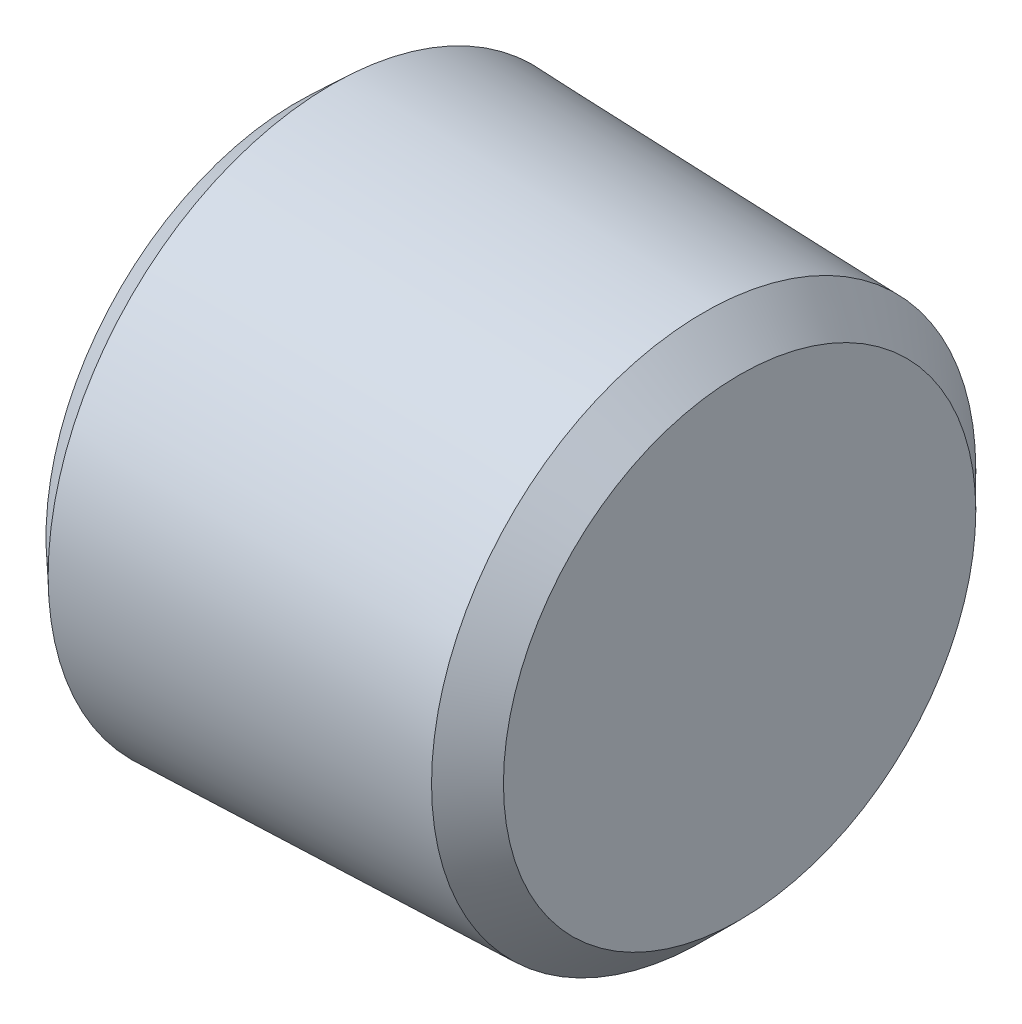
ISO-10303-21;
HEADER;
FILE_DESCRIPTION(('STEP AP214'),'2;1');
FILE_NAME('part.step','',(''),(''),'','','');
FILE_SCHEMA(('AUTOMOTIVE_DESIGN { 1 0 10303 214 1 1 1 1 }'));
ENDSEC;
DATA;
#1=APPLICATION_CONTEXT('core data for automotive mechanical design processes');
#2=APPLICATION_PROTOCOL_DEFINITION('international standard','automotive_design',2000,#1);
#3=PRODUCT_CONTEXT('',#1,'mechanical');
#4=PRODUCT('Part','Part','',(#3));
#5=PRODUCT_RELATED_PRODUCT_CATEGORY('part','',(#4));
#6=PRODUCT_DEFINITION_FORMATION('','',#4);
#7=PRODUCT_DEFINITION_CONTEXT('part definition',#1,'design');
#8=PRODUCT_DEFINITION('design','',#6,#7);
#9=PRODUCT_DEFINITION_SHAPE('','',#8);
#10=(LENGTH_UNIT() NAMED_UNIT(*) SI_UNIT(.MILLI.,.METRE.));
#11=(NAMED_UNIT(*) PLANE_ANGLE_UNIT() SI_UNIT($,.RADIAN.));
#12=(NAMED_UNIT(*) SI_UNIT($,.STERADIAN.) SOLID_ANGLE_UNIT());
#13=UNCERTAINTY_MEASURE_WITH_UNIT(LENGTH_MEASURE(1.E-05),#10,'distance_accuracy_value','');
#14=(GEOMETRIC_REPRESENTATION_CONTEXT(3) GLOBAL_UNCERTAINTY_ASSIGNED_CONTEXT((#13)) GLOBAL_UNIT_ASSIGNED_CONTEXT((#10,
#11,#12)) REPRESENTATION_CONTEXT('',''));
#15=CARTESIAN_POINT('',(0.,0.,0.));
#16=DIRECTION('',(0.,0.,1.));
#17=DIRECTION('',(1.,0.,0.));
#18=AXIS2_PLACEMENT_3D('',#15,#16,#17);
#19=CARTESIAN_POINT('',(10.8,6.61291308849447,0.));
#20=DIRECTION('',(-1.,0.,0.));
#21=DIRECTION('',(0.,0.,1.));
#22=AXIS2_PLACEMENT_3D('',#19,#20,#21);
#23=PLANE('',#22);
#24=CARTESIAN_POINT('',(10.8,0.,0.));
#25=DIRECTION('',(-1.,0.,0.));
#26=DIRECTION('',(0.,0.,1.));
#27=AXIS2_PLACEMENT_3D('',#24,#25,#26);
#28=CIRCLE('',#27,5.76291308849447);
#29=CARTESIAN_POINT('',(10.8,0.,5.76291308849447));
#30=VERTEX_POINT('',#29);
#31=EDGE_CURVE('E42',#30,#30,#28,.F.);
#32=ORIENTED_EDGE('',*,*,#31,.T.);
#33=EDGE_LOOP('',(#32));
#34=FACE_BOUND('',#33,.T.);
#35=ADVANCED_FACE('F34',(#34),#23,.F.);
#36=CARTESIAN_POINT('',(10.8,0.,0.));
#37=DIRECTION('',(-1.,0.,0.));
#38=DIRECTION('',(0.,0.,1.));
#39=AXIS2_PLACEMENT_3D('',#36,#37,#38);
#40=CONICAL_SURFACE('',#39,6.61291308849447,0.0311192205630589);
#41=CARTESIAN_POINT('',(9.92268997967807,0.,0.));
#42=DIRECTION('',(1.,0.,0.));
#43=DIRECTION('',(0.,0.,-1.));
#44=AXIS2_PLACEMENT_3D('',#41,#42,#43);
#45=CIRCLE('',#44,6.64022310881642);
#46=CARTESIAN_POINT('',(9.92268997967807,0.,-6.64022310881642));
#47=VERTEX_POINT('',#46);
#48=EDGE_CURVE('E144',#47,#47,#45,.F.);
#49=ORIENTED_EDGE('',*,*,#48,.T.);
#50=EDGE_LOOP('',(#49));
#51=FACE_BOUND('',#50,.T.);
#52=CARTESIAN_POINT('',(0.849588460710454,0.,0.));
#53=DIRECTION('',(1.,0.,0.));
#54=DIRECTION('',(0.,0.,-1.));
#55=AXIS2_PLACEMENT_3D('',#52,#53,#54);
#56=CIRCLE('',#55,6.92266213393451);
#57=CARTESIAN_POINT('',(0.849588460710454,0.,-6.92266213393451));
#58=VERTEX_POINT('',#57);
#59=EDGE_CURVE('E136',#58,#58,#56,.T.);
#60=ORIENTED_EDGE('',*,*,#59,.T.);
#61=EDGE_LOOP('',(#60));
#62=FACE_BOUND('',#61,.T.);
#63=ADVANCED_FACE('F159',(#51,#62),#40,.T.);
#64=CARTESIAN_POINT('',(0.,0.,0.));
#65=DIRECTION('',(1.,0.,0.));
#66=DIRECTION('',(0.,0.,-1.));
#67=AXIS2_PLACEMENT_3D('',#64,#65,#66);
#68=PLANE('',#67);
#69=DIRECTION('',(0.,0.866025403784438,-0.5));
#70=VECTOR('',#69,1.);
#71=CARTESIAN_POINT('',(0.,0.,3.66617420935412));
#72=LINE('',#71,#70);
#73=CARTESIAN_POINT('',(0.,0.,3.66617420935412));
#74=VERTEX_POINT('',#73);
#75=CARTESIAN_POINT('',(0.,3.175,1.83308710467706));
#76=VERTEX_POINT('',#75);
#77=EDGE_CURVE('E123',#74,#76,#72,.T.);
#78=ORIENTED_EDGE('',*,*,#77,.F.);
#79=DIRECTION('',(0.,0.866025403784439,0.5));
#80=VECTOR('',#79,1.);
#81=CARTESIAN_POINT('',(0.,-3.175,1.83308710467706));
#82=LINE('',#81,#80);
#83=CARTESIAN_POINT('',(0.,-3.175,1.83308710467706));
#84=VERTEX_POINT('',#83);
#85=EDGE_CURVE('E49',#84,#74,#82,.T.);
#86=ORIENTED_EDGE('',*,*,#85,.F.);
#87=DIRECTION('',(0.,0.,1.));
#88=VECTOR('',#87,1.);
#89=CARTESIAN_POINT('',(0.,-3.175,-1.83308710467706));
#90=LINE('',#89,#88);
#91=CARTESIAN_POINT('',(0.,-3.175,-1.83308710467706));
#92=VERTEX_POINT('',#91);
#93=EDGE_CURVE('E132',#92,#84,#90,.T.);
#94=ORIENTED_EDGE('',*,*,#93,.F.);
#95=DIRECTION('',(0.,-0.866025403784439,0.5));
#96=VECTOR('',#95,1.);
#97=CARTESIAN_POINT('',(0.,0.,-3.66617420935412));
#98=LINE('',#97,#96);
#99=CARTESIAN_POINT('',(0.,0.,-3.66617420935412));
#100=VERTEX_POINT('',#99);
#101=EDGE_CURVE('E130',#100,#92,#98,.T.);
#102=ORIENTED_EDGE('',*,*,#101,.F.);
#103=DIRECTION('',(0.,-0.866025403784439,-0.5));
#104=VECTOR('',#103,1.);
#105=CARTESIAN_POINT('',(0.,3.175,-1.83308710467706));
#106=LINE('',#105,#104);
#107=CARTESIAN_POINT('',(0.,3.175,-1.83308710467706));
#108=VERTEX_POINT('',#107);
#109=EDGE_CURVE('E97',#108,#100,#106,.T.);
#110=ORIENTED_EDGE('',*,*,#109,.F.);
#111=DIRECTION('',(0.,0.,-1.));
#112=VECTOR('',#111,1.);
#113=CARTESIAN_POINT('',(0.,3.175,1.83308710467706));
#114=LINE('',#113,#112);
#115=EDGE_CURVE('E126',#76,#108,#114,.T.);
#116=ORIENTED_EDGE('',*,*,#115,.F.);
#117=EDGE_LOOP('',(#78,#86,#94,#102,#110,#116));
#118=FACE_BOUND('',#117,.T.);
#119=CARTESIAN_POINT('',(0.,0.,0.));
#120=DIRECTION('',(1.,0.,0.));
#121=DIRECTION('',(0.,0.,-1.));
#122=AXIS2_PLACEMENT_3D('',#119,#120,#121);
#123=CIRCLE('',#122,6.12437096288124);
#124=CARTESIAN_POINT('',(0.,0.,-6.12437096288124));
#125=VERTEX_POINT('',#124);
#126=EDGE_CURVE('E11',#125,#125,#123,.F.);
#127=ORIENTED_EDGE('',*,*,#126,.T.);
#128=EDGE_LOOP('',(#127));
#129=FACE_BOUND('',#128,.T.);
#130=ADVANCED_FACE('F156',(#118,#129),#68,.F.);
#131=CARTESIAN_POINT('',(9.92268997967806,0.,0.));
#132=DIRECTION('',(-1.,0.,0.));
#133=DIRECTION('',(0.,0.,1.));
#134=AXIS2_PLACEMENT_3D('',#131,#132,#133);
#135=CONICAL_SURFACE('',#134,6.64022310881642,0.785398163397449);
#136=ORIENTED_EDGE('',*,*,#31,.F.);
#137=EDGE_LOOP('',(#136));
#138=FACE_BOUND('',#137,.T.);
#139=ORIENTED_EDGE('',*,*,#48,.F.);
#140=EDGE_LOOP('',(#139));
#141=FACE_BOUND('',#140,.T.);
#142=ADVANCED_FACE('F153',(#138,#141),#135,.T.);
#143=CARTESIAN_POINT('',(0.,0.,0.));
#144=DIRECTION('',(1.,0.,0.));
#145=DIRECTION('',(0.,0.,-1.));
#146=AXIS2_PLACEMENT_3D('',#143,#144,#145);
#147=CONICAL_SURFACE('',#146,6.12437096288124,0.754278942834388);
#148=ORIENTED_EDGE('',*,*,#59,.F.);
#149=EDGE_LOOP('',(#148));
#150=FACE_BOUND('',#149,.T.);
#151=ORIENTED_EDGE('',*,*,#126,.F.);
#152=EDGE_LOOP('',(#151));
#153=FACE_BOUND('',#152,.T.);
#154=ADVANCED_FACE('F36',(#150,#153),#147,.T.);
#155=CARTESIAN_POINT('',(3.,-3.175,1.83308710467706));
#156=DIRECTION('',(0.,-0.5,0.866025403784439));
#157=DIRECTION('',(0.,-0.866025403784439,-0.5));
#158=AXIS2_PLACEMENT_3D('',#155,#156,#157);
#159=PLANE('',#158);
#160=ORIENTED_EDGE('',*,*,#85,.T.);
#161=DIRECTION('',(-1.,0.,0.));
#162=VECTOR('',#161,1.);
#163=CARTESIAN_POINT('',(3.,0.,3.66617420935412));
#164=LINE('',#163,#162);
#165=CARTESIAN_POINT('',(3.,0.,3.66617420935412));
#166=VERTEX_POINT('',#165);
#167=EDGE_CURVE('E79',#166,#74,#164,.T.);
#168=ORIENTED_EDGE('',*,*,#167,.F.);
#169=DIRECTION('',(0.,0.866025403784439,0.5));
#170=VECTOR('',#169,1.);
#171=CARTESIAN_POINT('',(3.,-3.175,1.83308710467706));
#172=LINE('',#171,#170);
#173=CARTESIAN_POINT('',(3.,-3.175,1.83308710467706));
#174=VERTEX_POINT('',#173);
#175=EDGE_CURVE('E134',#174,#166,#172,.T.);
#176=ORIENTED_EDGE('',*,*,#175,.F.);
#177=DIRECTION('',(-1.,0.,0.));
#178=VECTOR('',#177,1.);
#179=CARTESIAN_POINT('',(3.,-3.175,1.83308710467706));
#180=LINE('',#179,#178);
#181=EDGE_CURVE('E57',#174,#84,#180,.T.);
#182=ORIENTED_EDGE('',*,*,#181,.T.);
#183=EDGE_LOOP('',(#160,#168,#176,#182));
#184=FACE_BOUND('',#183,.T.);
#185=ADVANCED_FACE('F167',(#184),#159,.F.);
#186=CARTESIAN_POINT('',(3.,-3.175,-1.83308710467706));
#187=DIRECTION('',(0.,-1.,0.));
#188=DIRECTION('',(0.,0.,-1.));
#189=AXIS2_PLACEMENT_3D('',#186,#187,#188);
#190=PLANE('',#189);
#191=ORIENTED_EDGE('',*,*,#93,.T.);
#192=ORIENTED_EDGE('',*,*,#181,.F.);
#193=DIRECTION('',(0.,0.,1.));
#194=VECTOR('',#193,1.);
#195=CARTESIAN_POINT('',(3.,-3.175,-1.83308710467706));
#196=LINE('',#195,#194);
#197=CARTESIAN_POINT('',(3.,-3.175,-1.83308710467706));
#198=VERTEX_POINT('',#197);
#199=EDGE_CURVE('E109',#198,#174,#196,.T.);
#200=ORIENTED_EDGE('',*,*,#199,.F.);
#201=DIRECTION('',(-1.,0.,0.));
#202=VECTOR('',#201,1.);
#203=CARTESIAN_POINT('',(3.,-3.175,-1.83308710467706));
#204=LINE('',#203,#202);
#205=EDGE_CURVE('E101',#198,#92,#204,.T.);
#206=ORIENTED_EDGE('',*,*,#205,.T.);
#207=EDGE_LOOP('',(#191,#192,#200,#206));
#208=FACE_BOUND('',#207,.T.);
#209=ADVANCED_FACE('F210',(#208),#190,.F.);
#210=CARTESIAN_POINT('',(3.,0.,-3.66617420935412));
#211=DIRECTION('',(0.,-0.5,-0.866025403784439));
#212=DIRECTION('',(0.,0.866025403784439,-0.5));
#213=AXIS2_PLACEMENT_3D('',#210,#211,#212);
#214=PLANE('',#213);
#215=ORIENTED_EDGE('',*,*,#101,.T.);
#216=ORIENTED_EDGE('',*,*,#205,.F.);
#217=DIRECTION('',(0.,-0.866025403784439,0.5));
#218=VECTOR('',#217,1.);
#219=CARTESIAN_POINT('',(3.,0.,-3.66617420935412));
#220=LINE('',#219,#218);
#221=CARTESIAN_POINT('',(3.,0.,-3.66617420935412));
#222=VERTEX_POINT('',#221);
#223=EDGE_CURVE('E105',#222,#198,#220,.T.);
#224=ORIENTED_EDGE('',*,*,#223,.F.);
#225=DIRECTION('',(-1.,0.,0.));
#226=VECTOR('',#225,1.);
#227=CARTESIAN_POINT('',(3.,0.,-3.66617420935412));
#228=LINE('',#227,#226);
#229=EDGE_CURVE('E90',#222,#100,#228,.T.);
#230=ORIENTED_EDGE('',*,*,#229,.T.);
#231=EDGE_LOOP('',(#215,#216,#224,#230));
#232=FACE_BOUND('',#231,.T.);
#233=ADVANCED_FACE('F106',(#232),#214,.F.);
#234=CARTESIAN_POINT('',(3.,3.175,-1.83308710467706));
#235=DIRECTION('',(0.,0.5,-0.866025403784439));
#236=DIRECTION('',(0.,0.866025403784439,0.5));
#237=AXIS2_PLACEMENT_3D('',#234,#235,#236);
#238=PLANE('',#237);
#239=ORIENTED_EDGE('',*,*,#109,.T.);
#240=ORIENTED_EDGE('',*,*,#229,.F.);
#241=DIRECTION('',(0.,-0.866025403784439,-0.5));
#242=VECTOR('',#241,1.);
#243=CARTESIAN_POINT('',(3.,3.175,-1.83308710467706));
#244=LINE('',#243,#242);
#245=CARTESIAN_POINT('',(3.,3.175,-1.83308710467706));
#246=VERTEX_POINT('',#245);
#247=EDGE_CURVE('E94',#246,#222,#244,.T.);
#248=ORIENTED_EDGE('',*,*,#247,.F.);
#249=DIRECTION('',(-1.,0.,0.));
#250=VECTOR('',#249,1.);
#251=CARTESIAN_POINT('',(3.,3.175,-1.83308710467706));
#252=LINE('',#251,#250);
#253=EDGE_CURVE('E102',#246,#108,#252,.T.);
#254=ORIENTED_EDGE('',*,*,#253,.T.);
#255=EDGE_LOOP('',(#239,#240,#248,#254));
#256=FACE_BOUND('',#255,.T.);
#257=ADVANCED_FACE('F92',(#256),#238,.F.);
#258=CARTESIAN_POINT('',(3.,3.175,1.83308710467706));
#259=DIRECTION('',(0.,1.,0.));
#260=DIRECTION('',(0.,0.,1.));
#261=AXIS2_PLACEMENT_3D('',#258,#259,#260);
#262=PLANE('',#261);
#263=ORIENTED_EDGE('',*,*,#115,.T.);
#264=ORIENTED_EDGE('',*,*,#253,.F.);
#265=DIRECTION('',(0.,0.,-1.));
#266=VECTOR('',#265,1.);
#267=CARTESIAN_POINT('',(3.,3.175,1.83308710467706));
#268=LINE('',#267,#266);
#269=CARTESIAN_POINT('',(3.,3.175,1.83308710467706));
#270=VERTEX_POINT('',#269);
#271=EDGE_CURVE('E115',#270,#246,#268,.T.);
#272=ORIENTED_EDGE('',*,*,#271,.F.);
#273=DIRECTION('',(-1.,0.,0.));
#274=VECTOR('',#273,1.);
#275=CARTESIAN_POINT('',(3.,3.175,1.83308710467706));
#276=LINE('',#275,#274);
#277=EDGE_CURVE('E139',#270,#76,#276,.T.);
#278=ORIENTED_EDGE('',*,*,#277,.T.);
#279=EDGE_LOOP('',(#263,#264,#272,#278));
#280=FACE_BOUND('',#279,.T.);
#281=ADVANCED_FACE('F234',(#280),#262,.F.);
#282=CARTESIAN_POINT('',(3.,0.,3.66617420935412));
#283=DIRECTION('',(0.,0.5,0.866025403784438));
#284=DIRECTION('',(0.,-0.866025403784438,0.5));
#285=AXIS2_PLACEMENT_3D('',#282,#283,#284);
#286=PLANE('',#285);
#287=ORIENTED_EDGE('',*,*,#77,.T.);
#288=ORIENTED_EDGE('',*,*,#277,.F.);
#289=DIRECTION('',(0.,0.866025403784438,-0.5));
#290=VECTOR('',#289,1.);
#291=CARTESIAN_POINT('',(3.,0.,3.66617420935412));
#292=LINE('',#291,#290);
#293=EDGE_CURVE('E117',#166,#270,#292,.T.);
#294=ORIENTED_EDGE('',*,*,#293,.F.);
#295=ORIENTED_EDGE('',*,*,#167,.T.);
#296=EDGE_LOOP('',(#287,#288,#294,#295));
#297=FACE_BOUND('',#296,.T.);
#298=ADVANCED_FACE('F243',(#297),#286,.F.);
#299=CARTESIAN_POINT('',(3.,3.175,5.49926131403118));
#300=DIRECTION('',(-1.,0.,0.));
#301=DIRECTION('',(0.,0.,1.));
#302=AXIS2_PLACEMENT_3D('',#299,#300,#301);
#303=PLANE('',#302);
#304=ORIENTED_EDGE('',*,*,#175,.T.);
#305=ORIENTED_EDGE('',*,*,#293,.T.);
#306=ORIENTED_EDGE('',*,*,#271,.T.);
#307=ORIENTED_EDGE('',*,*,#247,.T.);
#308=ORIENTED_EDGE('',*,*,#223,.T.);
#309=ORIENTED_EDGE('',*,*,#199,.T.);
#310=EDGE_LOOP('',(#304,#305,#306,#307,#308,#309));
#311=FACE_BOUND('',#310,.T.);
#312=ADVANCED_FACE('F112',(#311),#303,.T.);
#313=CLOSED_SHELL('',(#35,#63,#130,#142,#154,#185,#209,#233,#257,#281,#298,#312));
#314=MANIFOLD_SOLID_BREP('B2',#313);
#315=ADVANCED_BREP_SHAPE_REPRESENTATION('',(#18,#314),#14);
#316=SHAPE_DEFINITION_REPRESENTATION(#9,#315);
ENDSEC;
END-ISO-10303-21;
